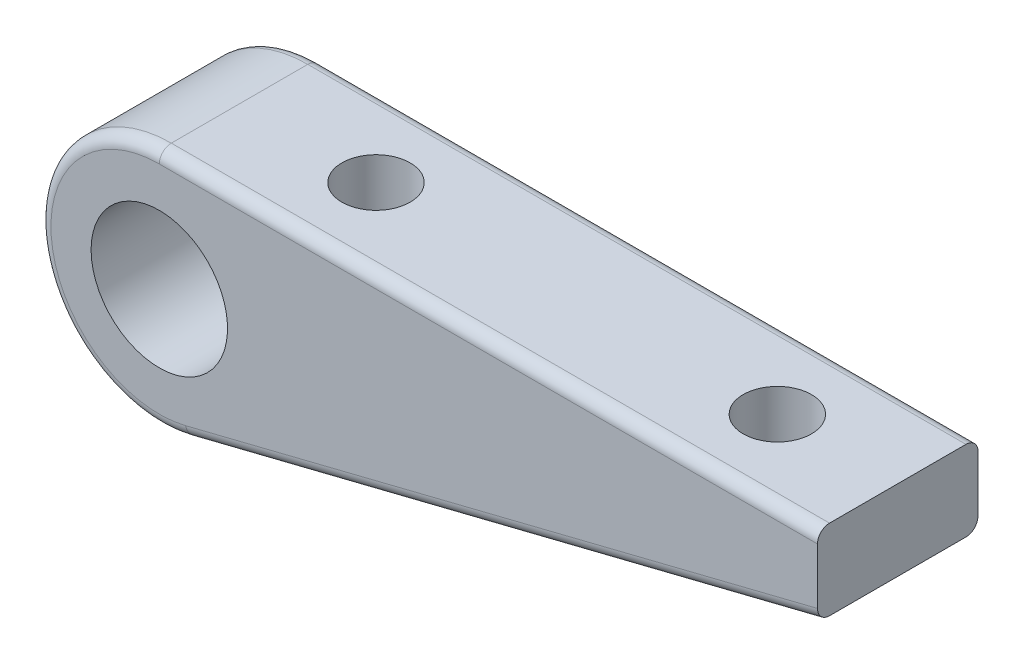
ISO-10303-21;
HEADER;
FILE_DESCRIPTION(('STEP AP214'),'2;1');
FILE_NAME('part.step','',(''),(''),'','','');
FILE_SCHEMA(('AUTOMOTIVE_DESIGN { 1 0 10303 214 1 1 1 1 }'));
ENDSEC;
DATA;
#1=APPLICATION_CONTEXT('core data for automotive mechanical design processes');
#2=APPLICATION_PROTOCOL_DEFINITION('international standard','automotive_design',2000,#1);
#3=PRODUCT_CONTEXT('',#1,'mechanical');
#4=PRODUCT('Part','Part','',(#3));
#5=PRODUCT_RELATED_PRODUCT_CATEGORY('part','',(#4));
#6=PRODUCT_DEFINITION_FORMATION('','',#4);
#7=PRODUCT_DEFINITION_CONTEXT('part definition',#1,'design');
#8=PRODUCT_DEFINITION('design','',#6,#7);
#9=PRODUCT_DEFINITION_SHAPE('','',#8);
#10=(LENGTH_UNIT() NAMED_UNIT(*) SI_UNIT(.MILLI.,.METRE.));
#11=(NAMED_UNIT(*) PLANE_ANGLE_UNIT() SI_UNIT($,.RADIAN.));
#12=(NAMED_UNIT(*) SI_UNIT($,.STERADIAN.) SOLID_ANGLE_UNIT());
#13=UNCERTAINTY_MEASURE_WITH_UNIT(LENGTH_MEASURE(1.E-05),#10,'distance_accuracy_value','');
#14=(GEOMETRIC_REPRESENTATION_CONTEXT(3) GLOBAL_UNCERTAINTY_ASSIGNED_CONTEXT((#13)) GLOBAL_UNIT_ASSIGNED_CONTEXT((#10,
#11,#12)) REPRESENTATION_CONTEXT('',''));
#15=CARTESIAN_POINT('',(0.,0.,0.));
#16=DIRECTION('',(0.,0.,1.));
#17=DIRECTION('',(1.,0.,0.));
#18=AXIS2_PLACEMENT_3D('',#15,#16,#17);
#19=CARTESIAN_POINT('',(67.,7.,0.));
#20=DIRECTION('',(0.,1.,0.));
#21=DIRECTION('',(-1.,0.,0.));
#22=AXIS2_PLACEMENT_3D('',#19,#20,#21);
#23=PLANE('',#22);
#24=CARTESIAN_POINT('',(67.,7.,0.));
#25=DIRECTION('',(0.,1.,0.));
#26=DIRECTION('',(-1.,0.,0.));
#27=AXIS2_PLACEMENT_3D('',#24,#25,#26);
#28=CIRCLE('',#27,7.);
#29=CARTESIAN_POINT('',(60.,7.,0.));
#30=VERTEX_POINT('',#29);
#31=EDGE_CURVE('E256',#30,#30,#28,.F.);
#32=ORIENTED_EDGE('',*,*,#31,.T.);
#33=EDGE_LOOP('',(#32));
#34=FACE_BOUND('',#33,.T.);
#35=CARTESIAN_POINT('',(67.,7.,0.));
#36=DIRECTION('',(0.,-1.,0.));
#37=DIRECTION('',(1.,0.,0.));
#38=AXIS2_PLACEMENT_3D('',#35,#36,#37);
#39=CIRCLE('',#38,4.25);
#40=CARTESIAN_POINT('',(71.25,7.,0.));
#41=VERTEX_POINT('',#40);
#42=EDGE_CURVE('E254',#41,#41,#39,.F.);
#43=ORIENTED_EDGE('',*,*,#42,.T.);
#44=EDGE_LOOP('',(#43));
#45=FACE_BOUND('',#44,.T.);
#46=ADVANCED_FACE('F16',(#34,#45),#23,.F.);
#47=CARTESIAN_POINT('',(17.,7.,0.));
#48=DIRECTION('',(0.,1.,0.));
#49=DIRECTION('',(-1.,0.,0.));
#50=AXIS2_PLACEMENT_3D('',#47,#48,#49);
#51=PLANE('',#50);
#52=CARTESIAN_POINT('',(17.,7.,0.));
#53=DIRECTION('',(0.,1.,0.));
#54=DIRECTION('',(-1.,0.,0.));
#55=AXIS2_PLACEMENT_3D('',#52,#53,#54);
#56=CIRCLE('',#55,7.);
#57=CARTESIAN_POINT('',(10.,7.,0.));
#58=VERTEX_POINT('',#57);
#59=EDGE_CURVE('E19',#58,#58,#56,.F.);
#60=ORIENTED_EDGE('',*,*,#59,.T.);
#61=EDGE_LOOP('',(#60));
#62=FACE_BOUND('',#61,.T.);
#63=CARTESIAN_POINT('',(17.,7.,0.));
#64=DIRECTION('',(0.,-1.,0.));
#65=DIRECTION('',(1.,0.,0.));
#66=AXIS2_PLACEMENT_3D('',#63,#64,#65);
#67=CIRCLE('',#66,4.25);
#68=CARTESIAN_POINT('',(21.25,7.,0.));
#69=VERTEX_POINT('',#68);
#70=EDGE_CURVE('E251',#69,#69,#67,.F.);
#71=ORIENTED_EDGE('',*,*,#70,.T.);
#72=EDGE_LOOP('',(#71));
#73=FACE_BOUND('',#72,.T.);
#74=ADVANCED_FACE('F263',(#62,#73),#51,.F.);
#75=CARTESIAN_POINT('',(17.,-15.,0.));
#76=DIRECTION('',(0.,1.,0.));
#77=DIRECTION('',(-1.,0.,0.));
#78=AXIS2_PLACEMENT_3D('',#75,#76,#77);
#79=CYLINDRICAL_SURFACE('',#78,7.);
#80=CARTESIAN_POINT('',(17.,-11.2181874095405,0.));
#81=DIRECTION('',(-0.242088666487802,0.970254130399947,0.));
#82=DIRECTION('',(0.970254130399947,0.242088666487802,0.));
#83=AXIS2_PLACEMENT_3D('',#80,#81,#82);
#84=ELLIPSE('',#83,7.21460469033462,7.);
#85=CARTESIAN_POINT('',(24.,-9.47161338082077,0.));
#86=VERTEX_POINT('',#85);
#87=EDGE_CURVE('E248',#86,#86,#84,.F.);
#88=ORIENTED_EDGE('',*,*,#87,.T.);
#89=EDGE_LOOP('',(#88));
#90=FACE_BOUND('',#89,.T.);
#91=ORIENTED_EDGE('',*,*,#59,.F.);
#92=EDGE_LOOP('',(#91));
#93=FACE_BOUND('',#92,.T.);
#94=ADVANCED_FACE('F266',(#90,#93),#79,.F.);
#95=CARTESIAN_POINT('',(67.,-15.,0.));
#96=DIRECTION('',(0.,1.,0.));
#97=DIRECTION('',(-1.,0.,0.));
#98=AXIS2_PLACEMENT_3D('',#95,#96,#97);
#99=CYLINDRICAL_SURFACE('',#98,7.);
#100=CARTESIAN_POINT('',(67.,1.25734136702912,0.));
#101=DIRECTION('',(-0.242088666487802,0.970254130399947,0.));
#102=DIRECTION('',(0.970254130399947,0.242088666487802,0.));
#103=AXIS2_PLACEMENT_3D('',#100,#101,#102);
#104=ELLIPSE('',#103,7.21460469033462,7.);
#105=CARTESIAN_POINT('',(74.,3.00391539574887,0.));
#106=VERTEX_POINT('',#105);
#107=EDGE_CURVE('E244',#106,#106,#104,.F.);
#108=ORIENTED_EDGE('',*,*,#107,.T.);
#109=EDGE_LOOP('',(#108));
#110=FACE_BOUND('',#109,.T.);
#111=ORIENTED_EDGE('',*,*,#31,.F.);
#112=EDGE_LOOP('',(#111));
#113=FACE_BOUND('',#112,.T.);
#114=ADVANCED_FACE('F268',(#110,#113),#99,.F.);
#115=CARTESIAN_POINT('',(67.,15.,0.));
#116=DIRECTION('',(0.,-1.,0.));
#117=DIRECTION('',(1.,0.,0.));
#118=AXIS2_PLACEMENT_3D('',#115,#116,#117);
#119=CYLINDRICAL_SURFACE('',#118,4.25);
#120=CARTESIAN_POINT('',(67.,15.,0.));
#121=DIRECTION('',(0.,-1.,0.));
#122=DIRECTION('',(1.,0.,0.));
#123=AXIS2_PLACEMENT_3D('',#120,#121,#122);
#124=CIRCLE('',#123,4.25);
#125=CARTESIAN_POINT('',(71.25,15.,0.));
#126=VERTEX_POINT('',#125);
#127=EDGE_CURVE('E222',#126,#126,#124,.F.);
#128=ORIENTED_EDGE('',*,*,#127,.T.);
#129=EDGE_LOOP('',(#128));
#130=FACE_BOUND('',#129,.T.);
#131=ORIENTED_EDGE('',*,*,#42,.F.);
#132=EDGE_LOOP('',(#131));
#133=FACE_BOUND('',#132,.T.);
#134=ADVANCED_FACE('F276',(#130,#133),#119,.F.);
#135=CARTESIAN_POINT('',(17.,15.,0.));
#136=DIRECTION('',(0.,-1.,0.));
#137=DIRECTION('',(1.,0.,0.));
#138=AXIS2_PLACEMENT_3D('',#135,#136,#137);
#139=CYLINDRICAL_SURFACE('',#138,4.25);
#140=CARTESIAN_POINT('',(17.,15.,0.));
#141=DIRECTION('',(0.,-1.,0.));
#142=DIRECTION('',(1.,0.,0.));
#143=AXIS2_PLACEMENT_3D('',#140,#141,#142);
#144=CIRCLE('',#143,4.25);
#145=CARTESIAN_POINT('',(21.25,15.,0.));
#146=VERTEX_POINT('',#145);
#147=EDGE_CURVE('E238',#146,#146,#144,.F.);
#148=ORIENTED_EDGE('',*,*,#147,.T.);
#149=EDGE_LOOP('',(#148));
#150=FACE_BOUND('',#149,.T.);
#151=ORIENTED_EDGE('',*,*,#70,.F.);
#152=EDGE_LOOP('',(#151));
#153=FACE_BOUND('',#152,.T.);
#154=ADVANCED_FACE('F203',(#150,#153),#139,.F.);
#155=CARTESIAN_POINT('',(0.,0.,8.5));
#156=DIRECTION('',(0.,0.,1.));
#157=DIRECTION('',(1.,0.,0.));
#158=AXIS2_PLACEMENT_3D('',#155,#156,#157);
#159=TOROIDAL_SURFACE('',#158,13.5,1.5);
#160=CARTESIAN_POINT('',(0.,0.,8.5));
#161=DIRECTION('',(0.,0.,-1.));
#162=DIRECTION('',(-1.,0.,0.));
#163=AXIS2_PLACEMENT_3D('',#160,#161,#162);
#164=CIRCLE('',#163,15.);
#165=CARTESIAN_POINT('',(3.63132999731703,-14.5538119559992,8.5));
#166=VERTEX_POINT('',#165);
#167=CARTESIAN_POINT('',(0.,15.,8.5));
#168=VERTEX_POINT('',#167);
#169=EDGE_CURVE('E226',#166,#168,#164,.T.);
#170=ORIENTED_EDGE('',*,*,#169,.F.);
#171=CARTESIAN_POINT('',(3.26819699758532,-13.0984307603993,8.5));
#172=DIRECTION('',(-0.970254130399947,-0.242088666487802,0.));
#173=DIRECTION('',(0.242088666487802,-0.970254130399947,0.));
#174=AXIS2_PLACEMENT_3D('',#171,#172,#173);
#175=CIRCLE('',#174,1.5);
#176=CARTESIAN_POINT('',(3.26819699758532,-13.0984307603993,10.));
#177=VERTEX_POINT('',#176);
#178=EDGE_CURVE('E247',#177,#166,#175,.F.);
#179=ORIENTED_EDGE('',*,*,#178,.F.);
#180=CARTESIAN_POINT('',(0.,0.,10.));
#181=DIRECTION('',(0.,0.,-1.));
#182=DIRECTION('',(0.242088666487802,-0.970254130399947,0.));
#183=AXIS2_PLACEMENT_3D('',#180,#181,#182);
#184=CIRCLE('',#183,13.5);
#185=CARTESIAN_POINT('',(0.,13.5,10.));
#186=VERTEX_POINT('',#185);
#187=EDGE_CURVE('E160',#186,#177,#184,.F.);
#188=ORIENTED_EDGE('',*,*,#187,.F.);
#189=CARTESIAN_POINT('',(0.,13.5,8.5));
#190=DIRECTION('',(1.,0.,0.));
#191=DIRECTION('',(0.,1.,0.));
#192=AXIS2_PLACEMENT_3D('',#189,#190,#191);
#193=CIRCLE('',#192,1.5);
#194=EDGE_CURVE('E215',#168,#186,#193,.T.);
#195=ORIENTED_EDGE('',*,*,#194,.F.);
#196=EDGE_LOOP('',(#170,#179,#188,#195));
#197=FACE_BOUND('',#196,.T.);
#198=ADVANCED_FACE('F197',(#197),#159,.T.);
#199=CARTESIAN_POINT('',(82.,5.,10.));
#200=DIRECTION('',(-0.242088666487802,0.970254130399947,0.));
#201=DIRECTION('',(-0.970254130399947,-0.242088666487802,0.));
#202=AXIS2_PLACEMENT_3D('',#199,#200,#201);
#203=PLANE('',#202);
#204=DIRECTION('',(0.970254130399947,0.242088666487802,0.));
#205=VECTOR('',#204,1.);
#206=CARTESIAN_POINT('',(82.,5.,-8.5));
#207=LINE('',#206,#205);
#208=CARTESIAN_POINT('',(82.,5.,-8.5));
#209=VERTEX_POINT('',#208);
#210=CARTESIAN_POINT('',(3.63132999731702,-14.5538119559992,-8.5));
#211=VERTEX_POINT('',#210);
#212=EDGE_CURVE('E91',#209,#211,#207,.F.);
#213=ORIENTED_EDGE('',*,*,#212,.F.);
#214=DIRECTION('',(0.,0.,1.));
#215=VECTOR('',#214,1.);
#216=CARTESIAN_POINT('',(82.,5.,10.));
#217=LINE('',#216,#215);
#218=CARTESIAN_POINT('',(82.,5.,8.5));
#219=VERTEX_POINT('',#218);
#220=EDGE_CURVE('E87',#209,#219,#217,.T.);
#221=ORIENTED_EDGE('',*,*,#220,.T.);
#222=DIRECTION('',(-0.970254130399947,-0.242088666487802,0.));
#223=VECTOR('',#222,1.);
#224=CARTESIAN_POINT('',(3.63132999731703,-14.5538119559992,8.5));
#225=LINE('',#224,#223);
#226=EDGE_CURVE('E223',#166,#219,#225,.F.);
#227=ORIENTED_EDGE('',*,*,#226,.F.);
#228=DIRECTION('',(0.,0.,-1.));
#229=VECTOR('',#228,1.);
#230=CARTESIAN_POINT('',(3.63132999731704,-14.5538119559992,10.));
#231=LINE('',#230,#229);
#232=EDGE_CURVE('E230',#211,#166,#231,.F.);
#233=ORIENTED_EDGE('',*,*,#232,.F.);
#234=EDGE_LOOP('',(#213,#221,#227,#233));
#235=FACE_BOUND('',#234,.T.);
#236=ORIENTED_EDGE('',*,*,#107,.F.);
#237=EDGE_LOOP('',(#236));
#238=FACE_BOUND('',#237,.T.);
#239=ORIENTED_EDGE('',*,*,#87,.F.);
#240=EDGE_LOOP('',(#239));
#241=FACE_BOUND('',#240,.T.);
#242=ADVANCED_FACE('F193',(#235,#238,#241),#203,.F.);
#243=CARTESIAN_POINT('',(3.26819699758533,-13.0984307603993,8.5));
#244=DIRECTION('',(-0.970254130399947,-0.242088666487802,0.));
#245=DIRECTION('',(0.242088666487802,-0.970254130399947,0.));
#246=AXIS2_PLACEMENT_3D('',#243,#244,#245);
#247=CYLINDRICAL_SURFACE('',#246,1.5);
#248=ORIENTED_EDGE('',*,*,#178,.T.);
#249=ORIENTED_EDGE('',*,*,#226,.T.);
#250=CARTESIAN_POINT('',(82.,6.54598671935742,8.5));
#251=DIRECTION('',(-1.,0.,0.));
#252=DIRECTION('',(0.,-1.,0.));
#253=AXIS2_PLACEMENT_3D('',#250,#251,#252);
#254=ELLIPSE('',#253,1.54598671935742,1.5);
#255=CARTESIAN_POINT('',(82.,6.54598671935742,10.));
#256=VERTEX_POINT('',#255);
#257=EDGE_CURVE('E150',#219,#256,#254,.T.);
#258=ORIENTED_EDGE('',*,*,#257,.T.);
#259=DIRECTION('',(0.970254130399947,0.242088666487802,0.));
#260=VECTOR('',#259,1.);
#261=CARTESIAN_POINT('',(3.26819699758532,-13.0984307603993,10.));
#262=LINE('',#261,#260);
#263=EDGE_CURVE('E153',#177,#256,#262,.T.);
#264=ORIENTED_EDGE('',*,*,#263,.F.);
#265=EDGE_LOOP('',(#248,#249,#258,#264));
#266=FACE_BOUND('',#265,.T.);
#267=ADVANCED_FACE('F189',(#266),#247,.T.);
#268=CARTESIAN_POINT('',(0.,13.5,8.5));
#269=DIRECTION('',(1.,0.,0.));
#270=DIRECTION('',(0.,1.,0.));
#271=AXIS2_PLACEMENT_3D('',#268,#269,#270);
#272=CYLINDRICAL_SURFACE('',#271,1.5);
#273=ORIENTED_EDGE('',*,*,#194,.T.);
#274=DIRECTION('',(1.,0.,0.));
#275=VECTOR('',#274,1.);
#276=CARTESIAN_POINT('',(0.,13.5,10.));
#277=LINE('',#276,#275);
#278=CARTESIAN_POINT('',(82.,13.5,10.));
#279=VERTEX_POINT('',#278);
#280=EDGE_CURVE('E323',#279,#186,#277,.F.);
#281=ORIENTED_EDGE('',*,*,#280,.F.);
#282=CARTESIAN_POINT('',(82.,13.5,8.5));
#283=DIRECTION('',(1.,0.,0.));
#284=DIRECTION('',(0.,1.,0.));
#285=AXIS2_PLACEMENT_3D('',#282,#283,#284);
#286=CIRCLE('',#285,1.5);
#287=CARTESIAN_POINT('',(82.,15.,8.5));
#288=VERTEX_POINT('',#287);
#289=EDGE_CURVE('E146',#279,#288,#286,.F.);
#290=ORIENTED_EDGE('',*,*,#289,.T.);
#291=DIRECTION('',(1.,0.,0.));
#292=VECTOR('',#291,1.);
#293=CARTESIAN_POINT('',(0.,15.,8.5));
#294=LINE('',#293,#292);
#295=EDGE_CURVE('E241',#288,#168,#294,.F.);
#296=ORIENTED_EDGE('',*,*,#295,.T.);
#297=EDGE_LOOP('',(#273,#281,#290,#296));
#298=FACE_BOUND('',#297,.T.);
#299=ADVANCED_FACE('F185',(#298),#272,.T.);
#300=CARTESIAN_POINT('',(0.,15.,10.));
#301=DIRECTION('',(0.,-1.,0.));
#302=DIRECTION('',(1.,0.,0.));
#303=AXIS2_PLACEMENT_3D('',#300,#301,#302);
#304=PLANE('',#303);
#305=DIRECTION('',(-1.,0.,0.));
#306=VECTOR('',#305,1.);
#307=CARTESIAN_POINT('',(0.,15.,-8.5));
#308=LINE('',#307,#306);
#309=CARTESIAN_POINT('',(0.,15.,-8.5));
#310=VERTEX_POINT('',#309);
#311=CARTESIAN_POINT('',(82.,15.,-8.5));
#312=VERTEX_POINT('',#311);
#313=EDGE_CURVE('E140',#310,#312,#308,.F.);
#314=ORIENTED_EDGE('',*,*,#313,.F.);
#315=DIRECTION('',(0.,0.,-1.));
#316=VECTOR('',#315,1.);
#317=CARTESIAN_POINT('',(0.,15.,10.));
#318=LINE('',#317,#316);
#319=EDGE_CURVE('E229',#168,#310,#318,.T.);
#320=ORIENTED_EDGE('',*,*,#319,.F.);
#321=ORIENTED_EDGE('',*,*,#295,.F.);
#322=DIRECTION('',(0.,0.,1.));
#323=VECTOR('',#322,1.);
#324=CARTESIAN_POINT('',(82.,15.,10.));
#325=LINE('',#324,#323);
#326=EDGE_CURVE('E143',#288,#312,#325,.F.);
#327=ORIENTED_EDGE('',*,*,#326,.T.);
#328=EDGE_LOOP('',(#314,#320,#321,#327));
#329=FACE_BOUND('',#328,.T.);
#330=ORIENTED_EDGE('',*,*,#147,.F.);
#331=EDGE_LOOP('',(#330));
#332=FACE_BOUND('',#331,.T.);
#333=ORIENTED_EDGE('',*,*,#127,.F.);
#334=EDGE_LOOP('',(#333));
#335=FACE_BOUND('',#334,.T.);
#336=ADVANCED_FACE('F181',(#329,#332,#335),#304,.F.);
#337=CARTESIAN_POINT('',(0.,0.,10.));
#338=DIRECTION('',(0.,0.,-1.));
#339=DIRECTION('',(-1.,0.,0.));
#340=AXIS2_PLACEMENT_3D('',#337,#338,#339);
#341=CYLINDRICAL_SURFACE('',#340,15.);
#342=ORIENTED_EDGE('',*,*,#319,.T.);
#343=CARTESIAN_POINT('',(0.,0.,-8.5));
#344=DIRECTION('',(0.,0.,1.));
#345=DIRECTION('',(1.,0.,0.));
#346=AXIS2_PLACEMENT_3D('',#343,#344,#345);
#347=CIRCLE('',#346,15.);
#348=EDGE_CURVE('E136',#211,#310,#347,.F.);
#349=ORIENTED_EDGE('',*,*,#348,.F.);
#350=ORIENTED_EDGE('',*,*,#232,.T.);
#351=ORIENTED_EDGE('',*,*,#169,.T.);
#352=EDGE_LOOP('',(#342,#349,#350,#351));
#353=FACE_BOUND('',#352,.T.);
#354=ADVANCED_FACE('F177',(#353),#341,.T.);
#355=CARTESIAN_POINT('',(0.,0.,10.));
#356=DIRECTION('',(0.,0.,1.));
#357=DIRECTION('',(1.,0.,0.));
#358=AXIS2_PLACEMENT_3D('',#355,#356,#357);
#359=PLANE('',#358);
#360=CARTESIAN_POINT('',(0.,0.,10.));
#361=DIRECTION('',(0.,0.,-1.));
#362=DIRECTION('',(-1.,0.,0.));
#363=AXIS2_PLACEMENT_3D('',#360,#361,#362);
#364=CIRCLE('',#363,8.5);
#365=CARTESIAN_POINT('',(-8.5,0.,10.));
#366=VERTEX_POINT('',#365);
#367=EDGE_CURVE('E104',#366,#366,#364,.T.);
#368=ORIENTED_EDGE('',*,*,#367,.T.);
#369=EDGE_LOOP('',(#368));
#370=FACE_BOUND('',#369,.T.);
#371=ORIENTED_EDGE('',*,*,#187,.T.);
#372=ORIENTED_EDGE('',*,*,#263,.T.);
#373=DIRECTION('',(0.,-1.,0.));
#374=VECTOR('',#373,1.);
#375=CARTESIAN_POINT('',(82.,15.,10.));
#376=LINE('',#375,#374);
#377=EDGE_CURVE('E147',#256,#279,#376,.F.);
#378=ORIENTED_EDGE('',*,*,#377,.T.);
#379=ORIENTED_EDGE('',*,*,#280,.T.);
#380=EDGE_LOOP('',(#371,#372,#378,#379));
#381=FACE_BOUND('',#380,.T.);
#382=ADVANCED_FACE('F167',(#370,#381),#359,.T.);
#383=CARTESIAN_POINT('',(81.6368670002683,6.45538119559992,-8.5));
#384=DIRECTION('',(0.970254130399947,0.242088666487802,0.));
#385=DIRECTION('',(-0.242088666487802,0.970254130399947,0.));
#386=AXIS2_PLACEMENT_3D('',#383,#384,#385);
#387=CYLINDRICAL_SURFACE('',#386,1.5);
#388=CARTESIAN_POINT('',(3.26819699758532,-13.0984307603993,-8.5));
#389=DIRECTION('',(0.970254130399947,0.242088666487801,0.));
#390=DIRECTION('',(0.242088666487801,-0.970254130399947,0.));
#391=AXIS2_PLACEMENT_3D('',#388,#389,#390);
#392=CIRCLE('',#391,1.5);
#393=CARTESIAN_POINT('',(3.26819699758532,-13.0984307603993,-10.));
#394=VERTEX_POINT('',#393);
#395=EDGE_CURVE('E103',#394,#211,#392,.F.);
#396=ORIENTED_EDGE('',*,*,#395,.F.);
#397=DIRECTION('',(0.970254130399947,0.242088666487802,0.));
#398=VECTOR('',#397,1.);
#399=CARTESIAN_POINT('',(3.26819699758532,-13.0984307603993,-10.));
#400=LINE('',#399,#398);
#401=CARTESIAN_POINT('',(82.,6.54598671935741,-10.));
#402=VERTEX_POINT('',#401);
#403=EDGE_CURVE('E96',#394,#402,#400,.T.);
#404=ORIENTED_EDGE('',*,*,#403,.T.);
#405=CARTESIAN_POINT('',(82.,6.54598671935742,-8.5));
#406=DIRECTION('',(-1.,0.,0.));
#407=DIRECTION('',(0.,1.,0.));
#408=AXIS2_PLACEMENT_3D('',#405,#406,#407);
#409=ELLIPSE('',#408,1.54598671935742,1.5);
#410=EDGE_CURVE('E80',#402,#209,#409,.T.);
#411=ORIENTED_EDGE('',*,*,#410,.T.);
#412=ORIENTED_EDGE('',*,*,#212,.T.);
#413=EDGE_LOOP('',(#396,#404,#411,#412));
#414=FACE_BOUND('',#413,.T.);
#415=ADVANCED_FACE('F101',(#414),#387,.T.);
#416=CARTESIAN_POINT('',(82.,15.,10.));
#417=DIRECTION('',(-1.,0.,0.));
#418=DIRECTION('',(0.,-1.,0.));
#419=AXIS2_PLACEMENT_3D('',#416,#417,#418);
#420=PLANE('',#419);
#421=CARTESIAN_POINT('',(82.,13.5,-8.5));
#422=DIRECTION('',(-1.,0.,0.));
#423=DIRECTION('',(0.,-1.,0.));
#424=AXIS2_PLACEMENT_3D('',#421,#422,#423);
#425=CIRCLE('',#424,1.5);
#426=CARTESIAN_POINT('',(82.,13.5,-10.));
#427=VERTEX_POINT('',#426);
#428=EDGE_CURVE('E145',#312,#427,#425,.T.);
#429=ORIENTED_EDGE('',*,*,#428,.F.);
#430=ORIENTED_EDGE('',*,*,#326,.F.);
#431=ORIENTED_EDGE('',*,*,#289,.F.);
#432=ORIENTED_EDGE('',*,*,#377,.F.);
#433=ORIENTED_EDGE('',*,*,#257,.F.);
#434=ORIENTED_EDGE('',*,*,#220,.F.);
#435=ORIENTED_EDGE('',*,*,#410,.F.);
#436=DIRECTION('',(0.,1.,0.));
#437=VECTOR('',#436,1.);
#438=CARTESIAN_POINT('',(82.,0.,-10.));
#439=LINE('',#438,#437);
#440=EDGE_CURVE('E84',#402,#427,#439,.T.);
#441=ORIENTED_EDGE('',*,*,#440,.T.);
#442=EDGE_LOOP('',(#429,#430,#431,#432,#433,#434,#435,#441));
#443=FACE_BOUND('',#442,.T.);
#444=ADVANCED_FACE('F83',(#443),#420,.F.);
#445=CARTESIAN_POINT('',(0.,13.5,-8.5));
#446=DIRECTION('',(-1.,0.,0.));
#447=DIRECTION('',(0.,-1.,0.));
#448=AXIS2_PLACEMENT_3D('',#445,#446,#447);
#449=CYLINDRICAL_SURFACE('',#448,1.5);
#450=CARTESIAN_POINT('',(0.,13.5,-8.5));
#451=DIRECTION('',(-1.,0.,0.));
#452=DIRECTION('',(0.,1.,0.));
#453=AXIS2_PLACEMENT_3D('',#450,#451,#452);
#454=CIRCLE('',#453,1.5);
#455=CARTESIAN_POINT('',(0.,13.5,-10.));
#456=VERTEX_POINT('',#455);
#457=EDGE_CURVE('E34',#310,#456,#454,.T.);
#458=ORIENTED_EDGE('',*,*,#457,.F.);
#459=ORIENTED_EDGE('',*,*,#313,.T.);
#460=ORIENTED_EDGE('',*,*,#428,.T.);
#461=DIRECTION('',(1.,0.,0.));
#462=VECTOR('',#461,1.);
#463=CARTESIAN_POINT('',(0.,13.5,-10.));
#464=LINE('',#463,#462);
#465=EDGE_CURVE('E99',#427,#456,#464,.F.);
#466=ORIENTED_EDGE('',*,*,#465,.T.);
#467=EDGE_LOOP('',(#458,#459,#460,#466));
#468=FACE_BOUND('',#467,.T.);
#469=ADVANCED_FACE('F124',(#468),#449,.T.);
#470=CARTESIAN_POINT('',(0.,0.,-8.5));
#471=DIRECTION('',(0.,0.,1.));
#472=DIRECTION('',(1.,0.,0.));
#473=AXIS2_PLACEMENT_3D('',#470,#471,#472);
#474=TOROIDAL_SURFACE('',#473,13.5,1.5);
#475=ORIENTED_EDGE('',*,*,#457,.T.);
#476=CARTESIAN_POINT('',(0.,0.,-10.));
#477=DIRECTION('',(0.,0.,1.));
#478=DIRECTION('',(0.,1.,0.));
#479=AXIS2_PLACEMENT_3D('',#476,#477,#478);
#480=CIRCLE('',#479,13.5);
#481=EDGE_CURVE('E25',#456,#394,#480,.T.);
#482=ORIENTED_EDGE('',*,*,#481,.T.);
#483=ORIENTED_EDGE('',*,*,#395,.T.);
#484=ORIENTED_EDGE('',*,*,#348,.T.);
#485=EDGE_LOOP('',(#475,#482,#483,#484));
#486=FACE_BOUND('',#485,.T.);
#487=ADVANCED_FACE('F118',(#486),#474,.T.);
#488=CARTESIAN_POINT('',(0.,0.,10.));
#489=DIRECTION('',(0.,0.,-1.));
#490=DIRECTION('',(-1.,0.,0.));
#491=AXIS2_PLACEMENT_3D('',#488,#489,#490);
#492=CYLINDRICAL_SURFACE('',#491,8.5);
#493=CARTESIAN_POINT('',(0.,0.,-10.));
#494=DIRECTION('',(0.,0.,-1.));
#495=DIRECTION('',(-1.,0.,0.));
#496=AXIS2_PLACEMENT_3D('',#493,#494,#495);
#497=CIRCLE('',#496,8.5);
#498=CARTESIAN_POINT('',(-8.5,0.,-10.));
#499=VERTEX_POINT('',#498);
#500=EDGE_CURVE('E11',#499,#499,#497,.T.);
#501=ORIENTED_EDGE('',*,*,#500,.T.);
#502=EDGE_LOOP('',(#501));
#503=FACE_BOUND('',#502,.T.);
#504=ORIENTED_EDGE('',*,*,#367,.F.);
#505=EDGE_LOOP('',(#504));
#506=FACE_BOUND('',#505,.T.);
#507=ADVANCED_FACE('F123',(#503,#506),#492,.F.);
#508=CARTESIAN_POINT('',(0.,0.,-10.));
#509=DIRECTION('',(0.,0.,1.));
#510=DIRECTION('',(1.,0.,0.));
#511=AXIS2_PLACEMENT_3D('',#508,#509,#510);
#512=PLANE('',#511);
#513=ORIENTED_EDGE('',*,*,#500,.F.);
#514=EDGE_LOOP('',(#513));
#515=FACE_BOUND('',#514,.T.);
#516=ORIENTED_EDGE('',*,*,#465,.F.);
#517=ORIENTED_EDGE('',*,*,#440,.F.);
#518=ORIENTED_EDGE('',*,*,#403,.F.);
#519=ORIENTED_EDGE('',*,*,#481,.F.);
#520=EDGE_LOOP('',(#516,#517,#518,#519));
#521=FACE_BOUND('',#520,.T.);
#522=ADVANCED_FACE('F95',(#515,#521),#512,.F.);
#523=CLOSED_SHELL('',(#46,#74,#94,#114,#134,#154,#198,#242,#267,#299,#336,#354,#382,#415,#444,
#469,#487,#507,#522));
#524=MANIFOLD_SOLID_BREP('B1',#523);
#525=ADVANCED_BREP_SHAPE_REPRESENTATION('',(#18,#524),#14);
#526=SHAPE_DEFINITION_REPRESENTATION(#9,#525);
ENDSEC;
END-ISO-10303-21;
